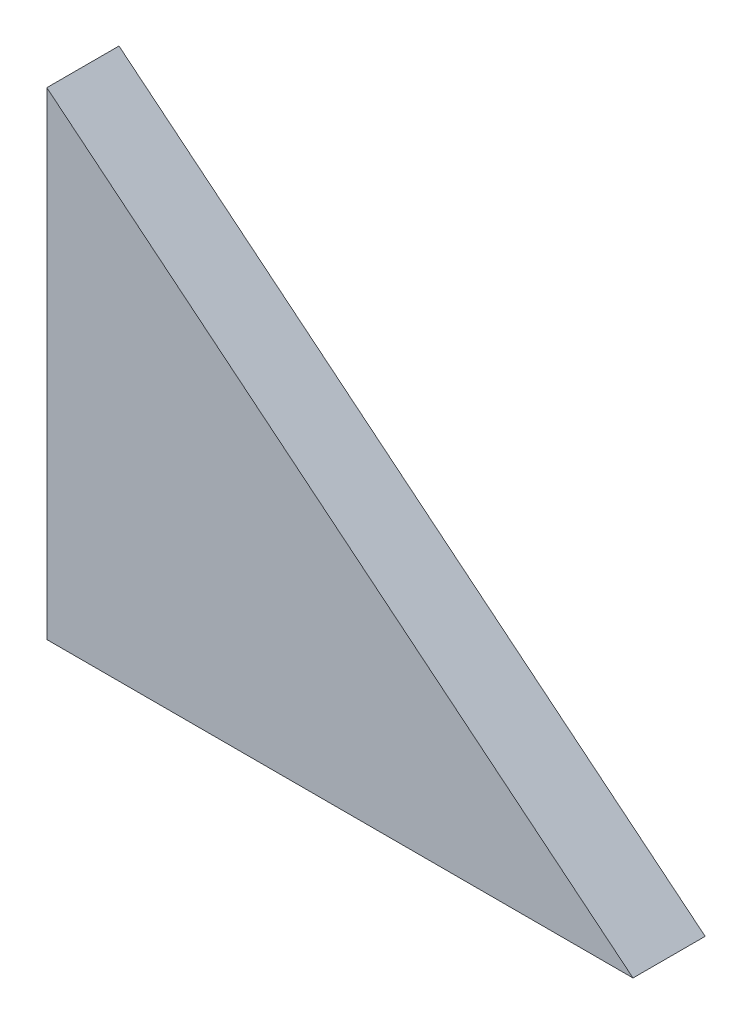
from build123d import *

# Parameters (mm, degrees)
EXTRUSION1_DEPTH = 8


with BuildPart() as part:
    # Esquisse1 → Extrusion1 (new body)
    with BuildSketch(Plane.XY):
        Polygon((0, 0), (0, 53), (65, 0), align=None)
    extrude(amount=EXTRUSION1_DEPTH)


solid = part.part
